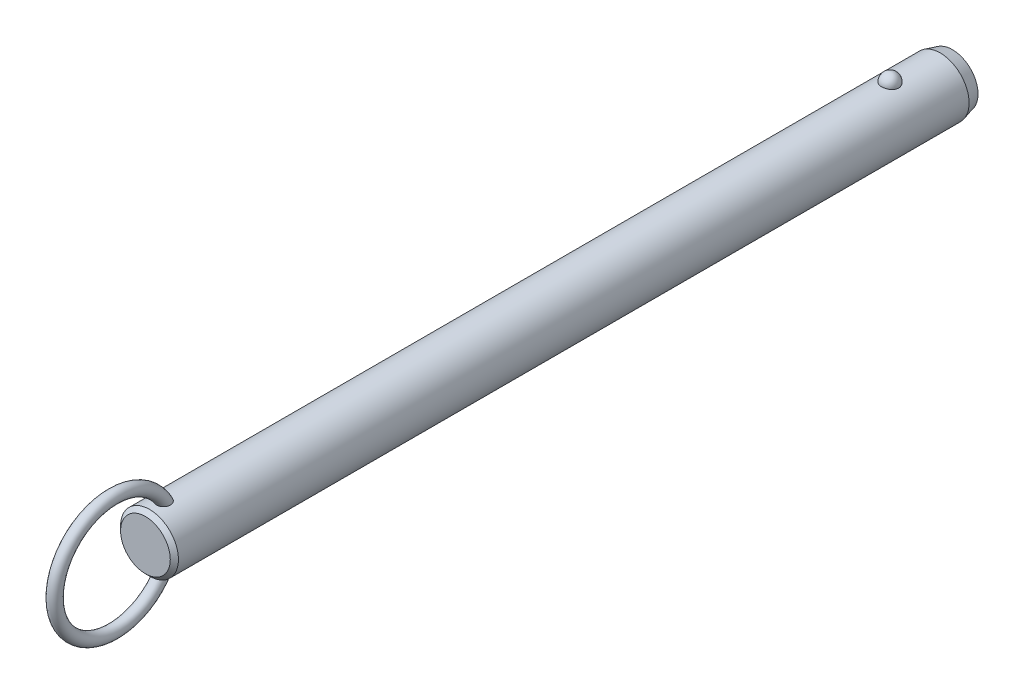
ISO-10303-21;
HEADER;
FILE_DESCRIPTION(('STEP AP214'),'2;1');
FILE_NAME('part.step','',(''),(''),'','','');
FILE_SCHEMA(('AUTOMOTIVE_DESIGN { 1 0 10303 214 1 1 1 1 }'));
ENDSEC;
DATA;
#1=APPLICATION_CONTEXT('core data for automotive mechanical design processes');
#2=APPLICATION_PROTOCOL_DEFINITION('international standard','automotive_design',2000,#1);
#3=PRODUCT_CONTEXT('',#1,'mechanical');
#4=PRODUCT('Part','Part','',(#3));
#5=PRODUCT_RELATED_PRODUCT_CATEGORY('part','',(#4));
#6=PRODUCT_DEFINITION_FORMATION('','',#4);
#7=PRODUCT_DEFINITION_CONTEXT('part definition',#1,'design');
#8=PRODUCT_DEFINITION('design','',#6,#7);
#9=PRODUCT_DEFINITION_SHAPE('','',#8);
#10=(LENGTH_UNIT() NAMED_UNIT(*) SI_UNIT(.MILLI.,.METRE.));
#11=(NAMED_UNIT(*) PLANE_ANGLE_UNIT() SI_UNIT($,.RADIAN.));
#12=(NAMED_UNIT(*) SI_UNIT($,.STERADIAN.) SOLID_ANGLE_UNIT());
#13=UNCERTAINTY_MEASURE_WITH_UNIT(LENGTH_MEASURE(1.E-05),#10,'distance_accuracy_value','');
#14=(GEOMETRIC_REPRESENTATION_CONTEXT(3) GLOBAL_UNCERTAINTY_ASSIGNED_CONTEXT((#13)) GLOBAL_UNIT_ASSIGNED_CONTEXT((#10,
#11,#12)) REPRESENTATION_CONTEXT('',''));
#15=CARTESIAN_POINT('',(0.,0.,0.));
#16=DIRECTION('',(0.,0.,1.));
#17=DIRECTION('',(1.,0.,0.));
#18=AXIS2_PLACEMENT_3D('',#15,#16,#17);
#19=CARTESIAN_POINT('',(0.,0.,172.7));
#20=DIRECTION('',(0.,0.,-1.));
#21=DIRECTION('',(-1.,0.,0.));
#22=AXIS2_PLACEMENT_3D('',#19,#20,#21);
#23=CYLINDRICAL_SURFACE('',#22,7.1);
#24=CARTESIAN_POINT('',(2.0769088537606,6.78943661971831,-2.1));
#25=CARTESIAN_POINT('',(2.07690739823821,6.78943796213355,-1.98268154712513));
#26=CARTESIAN_POINT('',(2.06738130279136,6.79237331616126,-1.86534506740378));
#27=CARTESIAN_POINT('',(2.0295040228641,6.8037853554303,-1.63400788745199));
#28=CARTESIAN_POINT('',(2.00114757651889,6.81226358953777,-1.52000812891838));
#29=CARTESIAN_POINT('',(1.92632025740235,6.83379798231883,-1.29863433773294));
#30=CARTESIAN_POINT('',(1.87985726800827,6.84685214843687,-1.19125744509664));
#31=CARTESIAN_POINT('',(1.76995205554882,6.87608091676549,-0.98604657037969));
#32=CARTESIAN_POINT('',(1.70650980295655,6.8922555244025,-0.88821260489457));
#33=CARTESIAN_POINT('',(1.5638119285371,6.92602930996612,-0.704242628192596));
#34=CARTESIAN_POINT('',(1.4844714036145,6.94363582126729,-0.618173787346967));
#35=CARTESIAN_POINT('',(1.31221746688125,6.97823658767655,-0.460740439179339));
#36=CARTESIAN_POINT('',(1.21930409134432,6.99523084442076,-0.389375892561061));
#37=CARTESIAN_POINT('',(1.02268781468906,7.02666176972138,-0.263547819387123));
#38=CARTESIAN_POINT('',(0.91902009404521,7.04110638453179,-0.209031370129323));
#39=CARTESIAN_POINT('',(0.703548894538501,7.06588726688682,-0.118163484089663));
#40=CARTESIAN_POINT('',(0.591746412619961,7.07622403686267,-0.0818098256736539));
#41=CARTESIAN_POINT('',(0.365557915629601,7.09147068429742,-0.0288711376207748));
#42=CARTESIAN_POINT('',(0.251267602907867,7.09648447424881,-0.0119070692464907));
#43=CARTESIAN_POINT('',(0.0213499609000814,7.10089837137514,0.00304925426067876));
#44=CARTESIAN_POINT('',(-0.0942772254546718,7.10029907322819,0.00104351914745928));
#45=CARTESIAN_POINT('',(-0.321651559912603,7.09360829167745,-0.0216931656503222));
#46=CARTESIAN_POINT('',(-0.433431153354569,7.08760388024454,-0.0421272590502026));
#47=CARTESIAN_POINT('',(-0.651862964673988,7.07086131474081,-0.100729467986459));
#48=CARTESIAN_POINT('',(-0.758515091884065,7.06012307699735,-0.138897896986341));
#49=CARTESIAN_POINT('',(-0.964449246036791,7.03496097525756,-0.232213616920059));
#50=CARTESIAN_POINT('',(-1.06368095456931,7.02051445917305,-0.287465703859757));
#51=CARTESIAN_POINT('',(-1.25145353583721,6.98948740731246,-0.413383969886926));
#52=CARTESIAN_POINT('',(-1.33999321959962,6.97290663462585,-0.48405186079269));
#53=CARTESIAN_POINT('',(-1.50591604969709,6.93898770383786,-0.640594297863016));
#54=CARTESIAN_POINT('',(-1.58302488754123,6.92164094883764,-0.726757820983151));
#55=CARTESIAN_POINT('',(-1.72189320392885,6.8884103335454,-0.91092752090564));
#56=CARTESIAN_POINT('',(-1.78365144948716,6.87252659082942,-1.008934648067));
#57=CARTESIAN_POINT('',(-1.89101272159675,6.84377189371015,-1.21549497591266));
#58=CARTESIAN_POINT('',(-1.93639553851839,6.83094274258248,-1.32416860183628));
#59=CARTESIAN_POINT('',(-2.00874275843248,6.81002070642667,-1.54791500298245));
#60=CARTESIAN_POINT('',(-2.03570774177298,6.80192767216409,-1.66298757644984));
#61=CARTESIAN_POINT('',(-2.07047276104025,6.7914266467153,-1.89571453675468));
#62=CARTESIAN_POINT('',(-2.07835878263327,6.78899315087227,-2.01335491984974));
#63=CARTESIAN_POINT('',(-2.07502083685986,6.79001409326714,-2.24833570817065));
#64=CARTESIAN_POINT('',(-2.06379746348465,6.7934683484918,-2.36567612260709));
#65=CARTESIAN_POINT('',(-2.02263913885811,6.80583442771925,-2.59603194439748));
#66=CARTESIAN_POINT('',(-1.99281127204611,6.81471501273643,-2.70906820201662));
#67=CARTESIAN_POINT('',(-1.91526639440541,6.83691232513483,-2.92836575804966));
#68=CARTESIAN_POINT('',(-1.8675486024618,6.85022924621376,-3.03462676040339));
#69=CARTESIAN_POINT('',(-1.75504492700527,6.87991336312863,-3.23806487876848));
#70=CARTESIAN_POINT('',(-1.69015924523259,6.89629822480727,-3.33518422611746));
#71=CARTESIAN_POINT('',(-1.54505404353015,6.93024852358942,-3.51697105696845));
#72=CARTESIAN_POINT('',(-1.46483385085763,6.94781401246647,-3.60163799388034));
#73=CARTESIAN_POINT('',(-1.29071406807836,6.98225977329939,-3.75654119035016));
#74=CARTESIAN_POINT('',(-1.19675650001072,6.99913673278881,-3.82671308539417));
#75=CARTESIAN_POINT('',(-0.997940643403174,7.03023618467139,-3.9501837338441));
#76=CARTESIAN_POINT('',(-0.89308318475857,7.04445887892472,-4.00348377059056));
#77=CARTESIAN_POINT('',(-0.676902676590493,7.06848365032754,-4.09107242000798));
#78=CARTESIAN_POINT('',(-0.565686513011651,7.0783430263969,-4.12560889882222));
#79=CARTESIAN_POINT('',(-0.338739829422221,7.09282534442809,-4.17575450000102));
#80=CARTESIAN_POINT('',(-0.223009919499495,7.09744899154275,-4.19136617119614));
#81=CARTESIAN_POINT('',(0.00707628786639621,7.10090930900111,-4.20307965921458));
#82=CARTESIAN_POINT('',(0.121410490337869,7.09986531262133,-4.19958377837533));
#83=CARTESIAN_POINT('',(0.347815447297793,7.092380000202,-4.17411564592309));
#84=CARTESIAN_POINT('',(0.459886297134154,7.08593891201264,-4.15214417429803));
#85=CARTESIAN_POINT('',(0.678084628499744,7.06838983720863,-4.09049562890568));
#86=CARTESIAN_POINT('',(0.784237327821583,7.05730369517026,-4.05090137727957));
#87=CARTESIAN_POINT('',(0.988305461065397,7.03163139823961,-3.95511447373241));
#88=CARTESIAN_POINT('',(1.08622031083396,7.01704499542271,-3.89892064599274));
#89=CARTESIAN_POINT('',(1.27284490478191,6.98562668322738,-3.77035541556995));
#90=CARTESIAN_POINT('',(1.36137372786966,6.96876135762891,-3.69772964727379));
#91=CARTESIAN_POINT('',(1.52509486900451,6.93477412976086,-3.53878279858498));
#92=CARTESIAN_POINT('',(1.60028496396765,6.91765218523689,-3.45245943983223));
#93=CARTESIAN_POINT('',(1.73681688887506,6.88465753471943,-3.26658774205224));
#94=CARTESIAN_POINT('',(1.79785966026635,6.86881574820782,-3.16681408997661));
#95=CARTESIAN_POINT('',(1.90265327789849,6.84053157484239,-2.95814408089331));
#96=CARTESIAN_POINT('',(1.94640861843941,6.82808830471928,-2.84925010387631));
#97=CARTESIAN_POINT('',(2.01274378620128,6.80881460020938,-2.63454318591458));
#98=CARTESIAN_POINT('',(2.03676193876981,6.80160856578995,-2.52920574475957));
#99=CARTESIAN_POINT('',(2.06884490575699,6.79191902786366,-2.3159172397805));
#100=CARTESIAN_POINT('',(2.07691019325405,6.78943538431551,-2.20796625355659));
#101=CARTESIAN_POINT('',(2.0769088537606,6.78943661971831,-2.1));
#102=B_SPLINE_CURVE_WITH_KNOTS('',3,(#24,#25,#26,#27,#28,#29,#30,#31,#32,#33,#34,#35,#36,#37,
#38,#39,#40,#41,#42,#43,#44,#45,#46,#47,#48,#49,#50,#51,#52,#53,#54,#55,#56,#57,#58,#59,#60,#61,
#62,#63,#64,#65,#66,#67,#68,#69,#70,#71,#72,#73,#74,#75,#76,#77,#78,#79,#80,#81,#82,#83,#84,#85,
#86,#87,#88,#89,#90,#91,#92,#93,#94,#95,#96,#97,#98,#99,#100,#101),.UNSPECIFIED.,.T.,.F.,(4,2,2,
2,2,2,2,2,2,2,2,2,2,2,2,2,2,2,2,2,2,2,2,2,2,2,2,2,2,2,2,2,2,2,2,2,2,2,4),(0.,0.351568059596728,
0.703234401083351,1.05474780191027,1.40626181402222,1.75970563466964,2.11314851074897,
2.4654696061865,2.81774759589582,3.16301449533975,3.50824481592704,3.84801136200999,
4.18778391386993,4.52968352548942,4.87162112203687,5.22076181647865,5.56993054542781,
5.92363364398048,6.27732559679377,6.62942052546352,6.98150450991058,7.33158042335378,
7.68167162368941,8.03384443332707,8.38603269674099,8.73975272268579,9.09344583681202,
9.44234545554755,9.79119807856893,10.1327344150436,10.4742563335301,10.8141898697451,
11.1541474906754,11.4997793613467,11.8454687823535,12.1979079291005,12.5502553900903,
12.8738073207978,13.1973496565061),.UNSPECIFIED.);
#103=CARTESIAN_POINT('',(2.0769088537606,6.78943661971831,-2.1));
#104=VERTEX_POINT('',#103);
#105=EDGE_CURVE('E41',#104,#104,#102,.T.);
#106=ORIENTED_EDGE('',*,*,#105,.T.);
#107=EDGE_LOOP('',(#106));
#108=FACE_BOUND('',#107,.T.);
#109=CARTESIAN_POINT('',(0.,0.,179.62));
#110=DIRECTION('',(0.,0.,1.));
#111=DIRECTION('',(1.,0.,0.));
#112=AXIS2_PLACEMENT_3D('',#109,#110,#111);
#113=CIRCLE('',#112,7.1);
#114=CARTESIAN_POINT('',(7.1,0.,179.62));
#115=VERTEX_POINT('',#114);
#116=EDGE_CURVE('E10',#115,#115,#113,.F.);
#117=ORIENTED_EDGE('',*,*,#116,.T.);
#118=EDGE_LOOP('',(#117));
#119=FACE_BOUND('',#118,.T.);
#120=CARTESIAN_POINT('',(-0.429539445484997,-7.08699541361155,174.442921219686));
#121=CARTESIAN_POINT('',(-0.508331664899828,-7.08221999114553,174.466876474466));
#122=CARTESIAN_POINT('',(-0.585039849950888,-7.07624016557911,174.497457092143));
#123=CARTESIAN_POINT('',(-0.73208265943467,-7.06254296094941,174.571024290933));
#124=CARTESIAN_POINT('',(-0.802417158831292,-7.05482554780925,174.614011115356));
#125=CARTESIAN_POINT('',(-0.934722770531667,-7.03851844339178,174.711113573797));
#126=CARTESIAN_POINT('',(-0.996700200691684,-7.02992941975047,174.765220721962));
#127=CARTESIAN_POINT('',(-1.11079942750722,-7.01280697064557,174.882967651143));
#128=CARTESIAN_POINT('',(-1.16292136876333,-7.00427354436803,174.946607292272));
#129=CARTESIAN_POINT('',(-1.25705660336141,-6.98799959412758,175.082687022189));
#130=CARTESIAN_POINT('',(-1.29888032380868,-6.98027525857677,175.155259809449));
#131=CARTESIAN_POINT('',(-1.37069920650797,-6.96652886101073,175.306168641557));
#132=CARTESIAN_POINT('',(-1.40069157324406,-6.96050720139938,175.384506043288));
#133=CARTESIAN_POINT('',(-1.45043507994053,-6.95031881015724,175.550190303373));
#134=CARTESIAN_POINT('',(-1.46937115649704,-6.94630231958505,175.637789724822));
#135=CARTESIAN_POINT('',(-1.49424917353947,-6.94099239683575,175.814871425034));
#136=CARTESIAN_POINT('',(-1.50018601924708,-6.93970003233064,175.904354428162));
#137=CARTESIAN_POINT('',(-1.49978214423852,-6.93978815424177,176.094060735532));
#138=CARTESIAN_POINT('',(-1.49187639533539,-6.94150934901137,176.194279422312));
#139=CARTESIAN_POINT('',(-1.46177925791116,-6.94790814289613,176.392479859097));
#140=CARTESIAN_POINT('',(-1.43957541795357,-6.95258831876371,176.490459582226));
#141=CARTESIAN_POINT('',(-1.37783293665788,-6.96510647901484,176.69536292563));
#142=CARTESIAN_POINT('',(-1.33634073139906,-6.97328848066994,176.801680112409));
#143=CARTESIAN_POINT('',(-1.23686994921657,-6.99161706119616,177.006177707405));
#144=CARTESIAN_POINT('',(-1.17889192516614,-7.00176357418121,177.104358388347));
#145=CARTESIAN_POINT('',(-1.0587512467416,-7.02082898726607,177.272374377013));
#146=CARTESIAN_POINT('',(-0.999247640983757,-7.02963746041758,177.344123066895));
#147=CARTESIAN_POINT('',(-0.869494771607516,-7.04686074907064,177.477195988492));
#148=CARTESIAN_POINT('',(-0.799263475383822,-7.05527619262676,177.538537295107));
#149=CARTESIAN_POINT('',(-0.665408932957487,-7.06899457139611,177.635131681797));
#150=CARTESIAN_POINT('',(-0.603817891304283,-7.07457275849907,177.673151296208));
#151=CARTESIAN_POINT('',(-0.475172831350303,-7.08437420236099,177.738758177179));
#152=CARTESIAN_POINT('',(-0.408123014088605,-7.08859848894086,177.766353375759));
#153=CARTESIAN_POINT('',(-0.269431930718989,-7.09522749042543,177.809256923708));
#154=CARTESIAN_POINT('',(-0.197757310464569,-7.09761688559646,177.824461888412));
#155=CARTESIAN_POINT('',(-0.0527849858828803,-7.10017268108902,177.840716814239));
#156=CARTESIAN_POINT('',(0.0205115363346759,-7.10034065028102,177.841776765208));
#157=CARTESIAN_POINT('',(0.156426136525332,-7.09855986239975,177.830461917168));
#158=CARTESIAN_POINT('',(0.219199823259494,-7.09688191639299,177.819806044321));
#159=CARTESIAN_POINT('',(0.342134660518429,-7.09201880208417,177.788537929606));
#160=CARTESIAN_POINT('',(0.402295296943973,-7.08883333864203,177.767923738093));
#161=CARTESIAN_POINT('',(0.520687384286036,-7.08113868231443,177.717212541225));
#162=CARTESIAN_POINT('',(0.578791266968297,-7.07658958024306,177.686827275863));
#163=CARTESIAN_POINT('',(0.690173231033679,-7.06659708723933,177.618367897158));
#164=CARTESIAN_POINT('',(0.743447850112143,-7.061153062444,177.580288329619));
#165=CARTESIAN_POINT('',(0.870947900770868,-7.04680292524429,177.476592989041));
#166=CARTESIAN_POINT('',(0.941828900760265,-7.03755800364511,177.406897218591));
#167=CARTESIAN_POINT('',(1.07136606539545,-7.01900793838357,177.256945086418));
#168=CARTESIAN_POINT('',(1.13000013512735,-7.00970271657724,177.176670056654));
#169=CARTESIAN_POINT('',(1.23579584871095,-6.99183327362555,177.006899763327));
#170=CARTESIAN_POINT('',(1.28274271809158,-6.98328455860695,176.917269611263));
#171=CARTESIAN_POINT('',(1.36351442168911,-6.96796352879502,176.732176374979));
#172=CARTESIAN_POINT('',(1.39733971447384,-6.96119115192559,176.636713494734));
#173=CARTESIAN_POINT('',(1.45579181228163,-6.94922464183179,176.42530928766));
#174=CARTESIAN_POINT('',(1.47790145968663,-6.94449000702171,176.308631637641));
#175=CARTESIAN_POINT('',(1.50168752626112,-6.93938731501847,176.073015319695));
#176=CARTESIAN_POINT('',(1.50336085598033,-6.93901991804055,175.95407631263));
#177=CARTESIAN_POINT('',(1.48486516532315,-6.9430010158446,175.72360799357));
#178=CARTESIAN_POINT('',(1.46573441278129,-6.9471253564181,175.611995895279));
#179=CARTESIAN_POINT('',(1.40606892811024,-6.95944667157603,175.394886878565));
#180=CARTESIAN_POINT('',(1.36556446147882,-6.96763788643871,175.2893815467));
#181=CARTESIAN_POINT('',(1.2708270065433,-6.98548038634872,175.104287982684));
#182=CARTESIAN_POINT('',(1.21949810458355,-6.99473841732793,175.023171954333));
#183=CARTESIAN_POINT('',(1.10242050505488,-7.01414069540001,174.872227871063));
#184=CARTESIAN_POINT('',(1.03668119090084,-7.02428436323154,174.80239252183));
#185=CARTESIAN_POINT('',(0.900559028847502,-7.04295285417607,174.683573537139));
#186=CARTESIAN_POINT('',(0.831428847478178,-7.05153466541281,174.633157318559));
#187=CARTESIAN_POINT('',(0.685291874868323,-7.06723150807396,174.545142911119));
#188=CARTESIAN_POINT('',(0.608287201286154,-7.07434693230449,174.507541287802));
#189=CARTESIAN_POINT('',(0.451878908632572,-7.08602232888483,174.447491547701));
#190=CARTESIAN_POINT('',(0.372686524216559,-7.09067127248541,174.424508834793));
#191=CARTESIAN_POINT('',(0.21147739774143,-7.09730788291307,174.392035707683));
#192=CARTESIAN_POINT('',(0.129460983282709,-7.09929585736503,174.38254373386));
#193=CARTESIAN_POINT('',(-0.0332905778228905,-7.10037858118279,174.377351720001));
#194=CARTESIAN_POINT('',(-0.114016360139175,-7.09953334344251,174.381365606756));
#195=CARTESIAN_POINT('',(-0.273670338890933,-7.09517338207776,174.402454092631));
#196=CARTESIAN_POINT('',(-0.352598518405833,-7.09165863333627,174.419528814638));
#197=CARTESIAN_POINT('',(-0.429539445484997,-7.08699541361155,174.442921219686));
#198=B_SPLINE_CURVE_WITH_KNOTS('',3,(#120,#121,#122,#123,#124,#125,#126,#127,#128,#129,#130,
#131,#132,#133,#134,#135,#136,#137,#138,#139,#140,#141,#142,#143,#144,#145,#146,#147,#148,#149,
#150,#151,#152,#153,#154,#155,#156,#157,#158,#159,#160,#161,#162,#163,#164,#165,#166,#167,#168,
#169,#170,#171,#172,#173,#174,#175,#176,#177,#178,#179,#180,#181,#182,#183,#184,#185,#186,#187,
#188,#189,#190,#191,#192,#193,#194,#195,#196,#197),.UNSPECIFIED.,.T.,.F.,(4,2,2,2,2,2,2,2,2,2,2,
2,2,2,2,2,2,2,2,2,2,2,2,2,2,2,2,2,2,2,2,2,2,2,2,2,2,2,4),(0.,0.247183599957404,
0.494372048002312,0.741372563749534,0.988369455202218,1.23962059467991,1.490931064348,
1.75897818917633,2.02713035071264,2.32758265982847,2.62829697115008,2.97008736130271,
3.31186629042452,3.59175319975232,3.87117637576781,4.08813841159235,4.30493502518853,
4.5235225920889,4.74195577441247,4.93215328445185,5.12238804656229,5.31884850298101,
5.51544871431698,5.81332317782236,6.11173048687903,6.41527266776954,6.71880423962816,
7.07358156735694,7.42841252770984,7.76631485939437,8.10373999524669,8.39142246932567,
8.67891817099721,8.93560332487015,9.19221962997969,9.43881106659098,9.68537399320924,
9.9267475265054,10.1681233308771),.UNSPECIFIED.);
#199=CARTESIAN_POINT('',(-0.429539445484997,-7.08699541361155,174.442921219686));
#200=VERTEX_POINT('',#199);
#201=EDGE_CURVE('E59',#200,#200,#198,.T.);
#202=ORIENTED_EDGE('',*,*,#201,.T.);
#203=EDGE_LOOP('',(#202));
#204=FACE_BOUND('',#203,.T.);
#205=CARTESIAN_POINT('',(-0.429539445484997,7.08699541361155,174.442921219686));
#206=CARTESIAN_POINT('',(-0.351665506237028,7.09171429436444,174.419246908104));
#207=CARTESIAN_POINT('',(-0.271733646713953,7.09525896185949,174.402036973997));
#208=CARTESIAN_POINT('',(-0.110026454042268,7.09960839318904,174.381005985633));
#209=CARTESIAN_POINT('',(-0.0282502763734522,7.10041187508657,174.377191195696));
#210=CARTESIAN_POINT('',(0.134782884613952,7.09918849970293,174.383059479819));
#211=CARTESIAN_POINT('',(0.216039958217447,7.09716214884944,174.39274013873));
#212=CARTESIAN_POINT('',(0.375730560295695,7.09050177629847,174.425347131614));
#213=CARTESIAN_POINT('',(0.454164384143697,7.08586802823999,174.448272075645));
#214=CARTESIAN_POINT('',(0.606025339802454,7.07449911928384,174.506771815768));
#215=CARTESIAN_POINT('',(0.67945100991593,7.06776334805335,174.542350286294));
#216=CARTESIAN_POINT('',(0.819234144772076,7.05292866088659,174.625175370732));
#217=CARTESIAN_POINT('',(0.88559181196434,7.04482978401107,174.672421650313));
#218=CARTESIAN_POINT('',(1.00993211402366,7.02808709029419,174.777590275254));
#219=CARTESIAN_POINT('',(1.06785399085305,7.01943990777,174.835583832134));
#220=CARTESIAN_POINT('',(1.17342527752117,7.00256662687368,174.960301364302));
#221=CARTESIAN_POINT('',(1.22107408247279,6.99434055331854,175.027025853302));
#222=CARTESIAN_POINT('',(1.30652927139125,6.97889183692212,175.169362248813));
#223=CARTESIAN_POINT('',(1.34399711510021,6.97170674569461,175.245180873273));
#224=CARTESIAN_POINT('',(1.40682616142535,6.95930080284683,175.401810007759));
#225=CARTESIAN_POINT('',(1.43218374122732,6.95408053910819,175.48262200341));
#226=CARTESIAN_POINT('',(1.47246409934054,6.94566853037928,175.653531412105));
#227=CARTESIAN_POINT('',(1.48642590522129,6.9426653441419,175.74386307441));
#228=CARTESIAN_POINT('',(1.5011410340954,6.93949744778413,175.925619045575));
#229=CARTESIAN_POINT('',(1.50188917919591,6.93933385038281,176.017043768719));
#230=CARTESIAN_POINT('',(1.49030464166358,6.94183245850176,176.21084381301));
#231=CARTESIAN_POINT('',(1.47627413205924,6.94486147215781,176.313112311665));
#232=CARTESIAN_POINT('',(1.43356351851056,6.95380194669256,176.514471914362));
#233=CARTESIAN_POINT('',(1.4048676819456,6.95971650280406,176.613559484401));
#234=CARTESIAN_POINT('',(1.32908750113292,6.97461208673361,176.818908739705));
#235=CARTESIAN_POINT('',(1.28011435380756,6.98388945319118,176.924456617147));
#236=CARTESIAN_POINT('',(1.16520357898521,7.00397743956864,177.125760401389));
#237=CARTESIAN_POINT('',(1.09927694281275,7.01478706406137,177.221522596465));
#238=CARTESIAN_POINT('',(0.969361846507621,7.03373936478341,177.376756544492));
#239=CARTESIAN_POINT('',(0.909042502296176,7.04187023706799,177.439303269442));
#240=CARTESIAN_POINT('',(0.779178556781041,7.05741732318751,177.554053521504));
#241=CARTESIAN_POINT('',(0.709649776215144,7.06483472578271,177.606274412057));
#242=CARTESIAN_POINT('',(0.576854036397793,7.0767751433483,177.688113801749));
#243=CARTESIAN_POINT('',(0.515118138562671,7.08158033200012,177.720164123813));
#244=CARTESIAN_POINT('',(0.387127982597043,7.08972701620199,177.773765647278));
#245=CARTESIAN_POINT('',(0.320877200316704,7.09306962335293,177.795324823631));
#246=CARTESIAN_POINT('',(0.185041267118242,7.09791507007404,177.826400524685));
#247=CARTESIAN_POINT('',(0.115437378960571,7.09940591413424,177.835838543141));
#248=CARTESIAN_POINT('',(-0.0243157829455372,7.10030171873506,177.841522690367));
#249=CARTESIAN_POINT('',(-0.0944648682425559,7.0997073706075,177.837773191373));
#250=CARTESIAN_POINT('',(-0.225713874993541,7.09668414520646,177.818508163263));
#251=CARTESIAN_POINT('',(-0.287006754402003,7.09444865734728,177.804232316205));
#252=CARTESIAN_POINT('',(-0.406555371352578,7.08860360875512,177.766368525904));
#253=CARTESIAN_POINT('',(-0.464809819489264,7.08499346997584,177.742776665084));
#254=CARTESIAN_POINT('',(-0.594955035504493,7.07541654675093,177.678923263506));
#255=CARTESIAN_POINT('',(-0.665389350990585,7.06906574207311,177.635753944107));
#256=CARTESIAN_POINT('',(-0.798242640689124,7.05530261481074,177.538587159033));
#257=CARTESIAN_POINT('',(-0.860645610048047,7.0478882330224,177.484568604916));
#258=CARTESIAN_POINT('',(-0.994249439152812,7.03045217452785,177.350996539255));
#259=CARTESIAN_POINT('',(-1.06260129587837,7.02030745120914,177.268614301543));
#260=CARTESIAN_POINT('',(-1.18502045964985,7.00068382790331,177.093843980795));
#261=CARTESIAN_POINT('',(-1.23907684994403,6.99120544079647,177.001448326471));
#262=CARTESIAN_POINT('',(-1.33335589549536,6.97384343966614,176.808008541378));
#263=CARTESIAN_POINT('',(-1.37336138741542,6.96598557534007,176.706856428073));
#264=CARTESIAN_POINT('',(-1.43770677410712,6.95299053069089,176.499504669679));
#265=CARTESIAN_POINT('',(-1.46204473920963,6.94785368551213,176.39330440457));
#266=CARTESIAN_POINT('',(-1.49537533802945,6.94076296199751,176.168231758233));
#267=CARTESIAN_POINT('',(-1.50273564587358,6.93914842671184,176.04909751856));
#268=CARTESIAN_POINT('',(-1.4954555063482,6.94072368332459,175.811470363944));
#269=CARTESIAN_POINT('',(-1.48082914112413,6.94391040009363,175.692977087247));
#270=CARTESIAN_POINT('',(-1.43076401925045,6.95438579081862,175.473432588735));
#271=CARTESIAN_POINT('',(-1.39762227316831,6.96121852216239,175.371841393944));
#272=CARTESIAN_POINT('',(-1.31211274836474,6.97783941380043,175.177351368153));
#273=CARTESIAN_POINT('',(-1.25976607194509,6.98762432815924,175.08444313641));
#274=CARTESIAN_POINT('',(-1.14583073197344,7.00713153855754,174.924160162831));
#275=CARTESIAN_POINT('',(-1.08665947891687,7.01665982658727,174.855035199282));
#276=CARTESIAN_POINT('',(-0.95660664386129,7.03556646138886,174.728878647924));
#277=CARTESIAN_POINT('',(-0.88573712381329,7.04494495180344,174.671834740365));
#278=CARTESIAN_POINT('',(-0.751558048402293,7.06035735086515,174.583100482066));
#279=CARTESIAN_POINT('',(-0.690120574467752,7.0666695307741,174.548593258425));
#280=CARTESIAN_POINT('',(-0.562815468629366,7.07794609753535,174.488750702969));
#281=CARTESIAN_POINT('',(-0.496948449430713,7.08291067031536,174.463414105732));
#282=CARTESIAN_POINT('',(-0.429539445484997,7.08699541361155,174.442921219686));
#283=B_SPLINE_CURVE_WITH_KNOTS('',3,(#205,#206,#207,#208,#209,#210,#211,#212,#213,#214,#215,
#216,#217,#218,#219,#220,#221,#222,#223,#224,#225,#226,#227,#228,#229,#230,#231,#232,#233,#234,
#235,#236,#237,#238,#239,#240,#241,#242,#243,#244,#245,#246,#247,#248,#249,#250,#251,#252,#253,
#254,#255,#256,#257,#258,#259,#260,#261,#262,#263,#264,#265,#266,#267,#268,#269,#270,#271,#272,
#273,#274,#275,#276,#277,#278,#279,#280,#281,#282),.UNSPECIFIED.,.T.,.F.,(4,2,2,2,2,2,2,2,2,2,2,
2,2,2,2,2,2,2,2,2,2,2,2,2,2,2,2,2,2,2,2,2,2,2,2,2,2,2,4),(0.,0.244335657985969,
0.488785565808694,0.733191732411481,0.977572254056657,1.2220237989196,1.46646834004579,
1.71259457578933,1.9587352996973,2.21226768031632,2.46587585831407,2.73913816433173,
3.01250754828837,3.32109936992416,3.63002293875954,3.9786351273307,4.32702187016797,
4.58793945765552,4.84841449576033,5.05676704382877,5.26496096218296,5.47449661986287,
5.68396281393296,5.87205447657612,6.06022532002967,6.30743751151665,6.55513496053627,
6.87602468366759,7.1971587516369,7.52305774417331,7.84899686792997,8.2051615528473,
8.56109821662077,8.88040084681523,9.19935367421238,9.47236282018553,9.74509220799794,
9.95662250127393,10.1681235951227),.UNSPECIFIED.);
#284=CARTESIAN_POINT('',(-0.429539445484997,7.08699541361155,174.442921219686));
#285=VERTEX_POINT('',#284);
#286=EDGE_CURVE('E67',#285,#285,#283,.T.);
#287=ORIENTED_EDGE('',*,*,#286,.T.);
#288=EDGE_LOOP('',(#287));
#289=FACE_BOUND('',#288,.T.);
#290=CARTESIAN_POINT('',(0.,0.,-14.4));
#291=DIRECTION('',(0.,0.,-1.));
#292=DIRECTION('',(-1.,0.,0.));
#293=AXIS2_PLACEMENT_3D('',#290,#291,#292);
#294=CIRCLE('',#293,7.1);
#295=CARTESIAN_POINT('',(-7.1,0.,-14.4));
#296=VERTEX_POINT('',#295);
#297=EDGE_CURVE('E56',#296,#296,#294,.F.);
#298=ORIENTED_EDGE('',*,*,#297,.T.);
#299=EDGE_LOOP('',(#298));
#300=FACE_BOUND('',#299,.T.);
#301=ADVANCED_FACE('F37',(#108,#119,#204,#289,#300),#23,.T.);
#302=CARTESIAN_POINT('',(0.,0.,-17.4));
#303=DIRECTION('',(0.,0.,-1.));
#304=DIRECTION('',(-1.,0.,0.));
#305=AXIS2_PLACEMENT_3D('',#302,#303,#304);
#306=PLANE('',#305);
#307=CARTESIAN_POINT('',(0.,0.,-17.4));
#308=DIRECTION('',(0.,0.,-1.));
#309=DIRECTION('',(-1.,0.,0.));
#310=AXIS2_PLACEMENT_3D('',#307,#308,#309);
#311=CIRCLE('',#310,6.29615242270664);
#312=CARTESIAN_POINT('',(-6.29615242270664,0.,-17.4));
#313=VERTEX_POINT('',#312);
#314=EDGE_CURVE('E66',#313,#313,#311,.T.);
#315=ORIENTED_EDGE('',*,*,#314,.T.);
#316=EDGE_LOOP('',(#315));
#317=FACE_BOUND('',#316,.T.);
#318=ADVANCED_FACE('F85',(#317),#306,.T.);
#319=CARTESIAN_POINT('',(0.,0.,-17.4));
#320=DIRECTION('',(0.,0.,1.));
#321=DIRECTION('',(1.,0.,0.));
#322=AXIS2_PLACEMENT_3D('',#319,#320,#321);
#323=CONICAL_SURFACE('',#322,6.29615242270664,0.261799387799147);
#324=ORIENTED_EDGE('',*,*,#297,.F.);
#325=EDGE_LOOP('',(#324));
#326=FACE_BOUND('',#325,.T.);
#327=ORIENTED_EDGE('',*,*,#314,.F.);
#328=EDGE_LOOP('',(#327));
#329=FACE_BOUND('',#328,.T.);
#330=ADVANCED_FACE('F83',(#326,#329),#323,.T.);
#331=CARTESIAN_POINT('',(0.,0.,180.62));
#332=DIRECTION('',(0.,0.,1.));
#333=DIRECTION('',(1.,0.,0.));
#334=AXIS2_PLACEMENT_3D('',#331,#332,#333);
#335=PLANE('',#334);
#336=CARTESIAN_POINT('',(0.,0.,180.62));
#337=DIRECTION('',(0.,0.,1.));
#338=DIRECTION('',(1.,0.,0.));
#339=AXIS2_PLACEMENT_3D('',#336,#337,#338);
#340=CIRCLE('',#339,6.09999999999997);
#341=CARTESIAN_POINT('',(6.09999999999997,0.,180.62));
#342=VERTEX_POINT('',#341);
#343=EDGE_CURVE('E50',#342,#342,#340,.T.);
#344=ORIENTED_EDGE('',*,*,#343,.T.);
#345=EDGE_LOOP('',(#344));
#346=FACE_BOUND('',#345,.T.);
#347=ADVANCED_FACE('F77',(#346),#335,.T.);
#348=CARTESIAN_POINT('',(0.,0.,188.55));
#349=DIRECTION('',(1.,0.,0.));
#350=DIRECTION('',(0.,0.,-1.));
#351=AXIS2_PLACEMENT_3D('',#348,#349,#350);
#352=TOROIDAL_SURFACE('',#351,14.35,1.5);
#353=ORIENTED_EDGE('',*,*,#286,.F.);
#354=EDGE_LOOP('',(#353));
#355=FACE_BOUND('',#354,.T.);
#356=ORIENTED_EDGE('',*,*,#201,.F.);
#357=EDGE_LOOP('',(#356));
#358=FACE_BOUND('',#357,.T.);
#359=ADVANCED_FACE('F73',(#355,#358),#352,.T.);
#360=CARTESIAN_POINT('',(0.,0.,180.62));
#361=DIRECTION('',(0.,0.,-1.));
#362=DIRECTION('',(-1.,0.,0.));
#363=AXIS2_PLACEMENT_3D('',#360,#361,#362);
#364=CONICAL_SURFACE('',#363,6.09999999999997,0.78539816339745);
#365=ORIENTED_EDGE('',*,*,#116,.F.);
#366=EDGE_LOOP('',(#365));
#367=FACE_BOUND('',#366,.T.);
#368=ORIENTED_EDGE('',*,*,#343,.F.);
#369=EDGE_LOOP('',(#368));
#370=FACE_BOUND('',#369,.T.);
#371=ADVANCED_FACE('F39',(#367,#370),#364,.T.);
#372=CARTESIAN_POINT('',(0.,7.1,-2.1));
#373=DIRECTION('',(0.,1.,0.));
#374=DIRECTION('',(0.,0.,1.));
#375=AXIS2_PLACEMENT_3D('',#372,#373,#374);
#376=SPHERICAL_SURFACE('',#375,2.10000000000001);
#377=ORIENTED_EDGE('',*,*,#105,.F.);
#378=EDGE_LOOP('',(#377));
#379=FACE_BOUND('',#378,.T.);
#380=ADVANCED_FACE('F79',(#379),#376,.T.);
#381=CLOSED_SHELL('',(#301,#318,#330,#347,#359,#371,#380));
#382=MANIFOLD_SOLID_BREP('B2',#381);
#383=ADVANCED_BREP_SHAPE_REPRESENTATION('',(#18,#382),#14);
#384=SHAPE_DEFINITION_REPRESENTATION(#9,#383);
ENDSEC;
END-ISO-10303-21;
